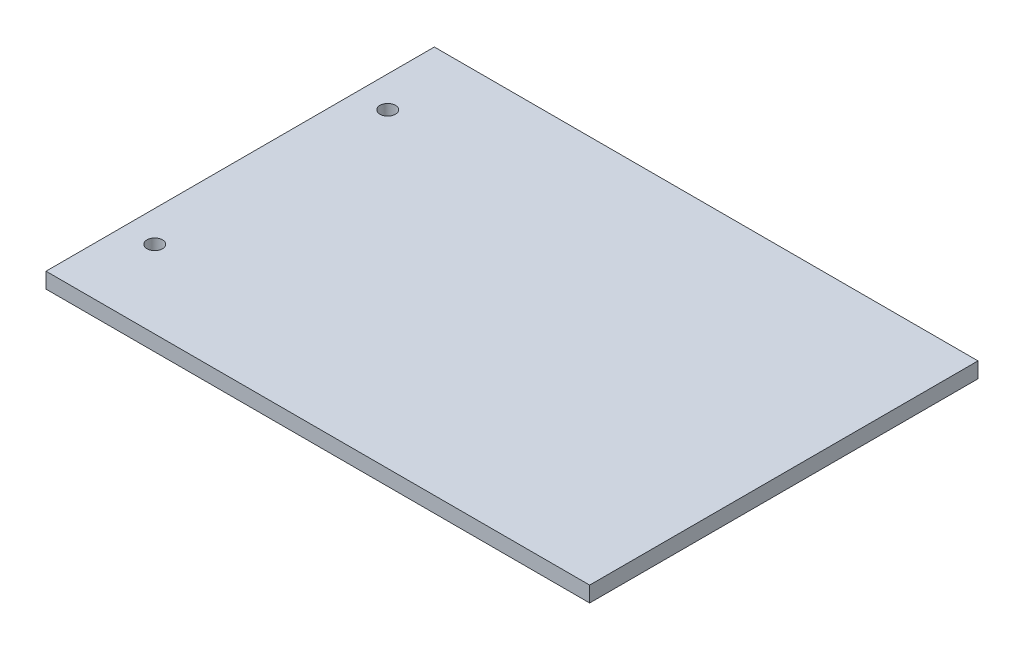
ISO-10303-21;
HEADER;
FILE_DESCRIPTION(('STEP AP214'),'2;1');
FILE_NAME('part.step','',(''),(''),'','','');
FILE_SCHEMA(('AUTOMOTIVE_DESIGN { 1 0 10303 214 1 1 1 1 }'));
ENDSEC;
DATA;
#1=APPLICATION_CONTEXT('core data for automotive mechanical design processes');
#2=APPLICATION_PROTOCOL_DEFINITION('international standard','automotive_design',2000,#1);
#3=PRODUCT_CONTEXT('',#1,'mechanical');
#4=PRODUCT('Part','Part','',(#3));
#5=PRODUCT_RELATED_PRODUCT_CATEGORY('part','',(#4));
#6=PRODUCT_DEFINITION_FORMATION('','',#4);
#7=PRODUCT_DEFINITION_CONTEXT('part definition',#1,'design');
#8=PRODUCT_DEFINITION('design','',#6,#7);
#9=PRODUCT_DEFINITION_SHAPE('','',#8);
#10=(LENGTH_UNIT() NAMED_UNIT(*) SI_UNIT(.MILLI.,.METRE.));
#11=(NAMED_UNIT(*) PLANE_ANGLE_UNIT() SI_UNIT($,.RADIAN.));
#12=(NAMED_UNIT(*) SI_UNIT($,.STERADIAN.) SOLID_ANGLE_UNIT());
#13=UNCERTAINTY_MEASURE_WITH_UNIT(LENGTH_MEASURE(1.E-05),#10,'distance_accuracy_value','');
#14=(GEOMETRIC_REPRESENTATION_CONTEXT(3) GLOBAL_UNCERTAINTY_ASSIGNED_CONTEXT((#13)) GLOBAL_UNIT_ASSIGNED_CONTEXT((#10,
#11,#12)) REPRESENTATION_CONTEXT('',''));
#15=CARTESIAN_POINT('',(0.,0.,0.));
#16=DIRECTION('',(0.,0.,1.));
#17=DIRECTION('',(1.,0.,0.));
#18=AXIS2_PLACEMENT_3D('',#15,#16,#17);
#19=CARTESIAN_POINT('',(0.,2.,0.));
#20=DIRECTION('',(0.,1.,0.));
#21=DIRECTION('',(0.,0.,1.));
#22=AXIS2_PLACEMENT_3D('',#19,#20,#21);
#23=PLANE('',#22);
#24=CARTESIAN_POINT('',(-31.,2.,-15.));
#25=DIRECTION('',(0.,1.,0.));
#26=DIRECTION('',(0.,0.,1.));
#27=AXIS2_PLACEMENT_3D('',#24,#25,#26);
#28=CIRCLE('',#27,1.);
#29=CARTESIAN_POINT('',(-31.,2.,-14.));
#30=VERTEX_POINT('',#29);
#31=EDGE_CURVE('E100',#30,#30,#28,.T.);
#32=ORIENTED_EDGE('',*,*,#31,.F.);
#33=EDGE_LOOP('',(#32));
#34=FACE_BOUND('',#33,.T.);
#35=DIRECTION('',(0.,0.,-1.));
#36=VECTOR('',#35,1.);
#37=CARTESIAN_POINT('',(35.,2.,-25.));
#38=LINE('',#37,#36);
#39=CARTESIAN_POINT('',(35.,2.,25.));
#40=VERTEX_POINT('',#39);
#41=CARTESIAN_POINT('',(35.,2.,-25.));
#42=VERTEX_POINT('',#41);
#43=EDGE_CURVE('E85',#40,#42,#38,.T.);
#44=ORIENTED_EDGE('',*,*,#43,.T.);
#45=DIRECTION('',(-1.,0.,0.));
#46=VECTOR('',#45,1.);
#47=CARTESIAN_POINT('',(-35.,2.,-25.));
#48=LINE('',#47,#46);
#49=CARTESIAN_POINT('',(-35.,2.,-25.));
#50=VERTEX_POINT('',#49);
#51=EDGE_CURVE('E80',#42,#50,#48,.T.);
#52=ORIENTED_EDGE('',*,*,#51,.T.);
#53=DIRECTION('',(0.,0.,1.));
#54=VECTOR('',#53,1.);
#55=CARTESIAN_POINT('',(-35.,2.,-25.));
#56=LINE('',#55,#54);
#57=CARTESIAN_POINT('',(-35.,2.,25.));
#58=VERTEX_POINT('',#57);
#59=EDGE_CURVE('E83',#50,#58,#56,.T.);
#60=ORIENTED_EDGE('',*,*,#59,.T.);
#61=DIRECTION('',(1.,0.,0.));
#62=VECTOR('',#61,1.);
#63=CARTESIAN_POINT('',(-35.,2.,25.));
#64=LINE('',#63,#62);
#65=EDGE_CURVE('E50',#58,#40,#64,.T.);
#66=ORIENTED_EDGE('',*,*,#65,.T.);
#67=EDGE_LOOP('',(#44,#52,#60,#66));
#68=FACE_BOUND('',#67,.T.);
#69=CARTESIAN_POINT('',(-31.,2.,15.));
#70=DIRECTION('',(0.,1.,0.));
#71=DIRECTION('',(0.,0.,1.));
#72=AXIS2_PLACEMENT_3D('',#69,#70,#71);
#73=CIRCLE('',#72,1.);
#74=CARTESIAN_POINT('',(-31.,2.,16.));
#75=VERTEX_POINT('',#74);
#76=EDGE_CURVE('E115',#75,#75,#73,.T.);
#77=ORIENTED_EDGE('',*,*,#76,.F.);
#78=EDGE_LOOP('',(#77));
#79=FACE_BOUND('',#78,.T.);
#80=ADVANCED_FACE('F33',(#34,#68,#79),#23,.T.);
#81=CARTESIAN_POINT('',(0.,0.,0.));
#82=DIRECTION('',(0.,1.,0.));
#83=DIRECTION('',(0.,0.,1.));
#84=AXIS2_PLACEMENT_3D('',#81,#82,#83);
#85=PLANE('',#84);
#86=DIRECTION('',(0.,0.,-1.));
#87=VECTOR('',#86,1.);
#88=CARTESIAN_POINT('',(35.,0.,-25.));
#89=LINE('',#88,#87);
#90=CARTESIAN_POINT('',(35.,0.,25.));
#91=VERTEX_POINT('',#90);
#92=CARTESIAN_POINT('',(35.,0.,-25.));
#93=VERTEX_POINT('',#92);
#94=EDGE_CURVE('E97',#91,#93,#89,.T.);
#95=ORIENTED_EDGE('',*,*,#94,.F.);
#96=DIRECTION('',(1.,0.,0.));
#97=VECTOR('',#96,1.);
#98=CARTESIAN_POINT('',(-35.,0.,25.));
#99=LINE('',#98,#97);
#100=CARTESIAN_POINT('',(-35.,0.,25.));
#101=VERTEX_POINT('',#100);
#102=EDGE_CURVE('E73',#101,#91,#99,.T.);
#103=ORIENTED_EDGE('',*,*,#102,.F.);
#104=DIRECTION('',(0.,0.,1.));
#105=VECTOR('',#104,1.);
#106=CARTESIAN_POINT('',(-35.,0.,-25.));
#107=LINE('',#106,#105);
#108=CARTESIAN_POINT('',(-35.,0.,-25.));
#109=VERTEX_POINT('',#108);
#110=EDGE_CURVE('E67',#109,#101,#107,.T.);
#111=ORIENTED_EDGE('',*,*,#110,.F.);
#112=DIRECTION('',(-1.,0.,0.));
#113=VECTOR('',#112,1.);
#114=CARTESIAN_POINT('',(-35.,0.,-25.));
#115=LINE('',#114,#113);
#116=EDGE_CURVE('E89',#93,#109,#115,.T.);
#117=ORIENTED_EDGE('',*,*,#116,.F.);
#118=EDGE_LOOP('',(#95,#103,#111,#117));
#119=FACE_BOUND('',#118,.T.);
#120=CARTESIAN_POINT('',(-31.,0.,-15.));
#121=DIRECTION('',(0.,1.,0.));
#122=DIRECTION('',(0.,0.,1.));
#123=AXIS2_PLACEMENT_3D('',#120,#121,#122);
#124=CIRCLE('',#123,1.);
#125=CARTESIAN_POINT('',(-31.,0.,-14.));
#126=VERTEX_POINT('',#125);
#127=EDGE_CURVE('E112',#126,#126,#124,.T.);
#128=ORIENTED_EDGE('',*,*,#127,.T.);
#129=EDGE_LOOP('',(#128));
#130=FACE_BOUND('',#129,.T.);
#131=CARTESIAN_POINT('',(-31.,0.,15.));
#132=DIRECTION('',(0.,1.,0.));
#133=DIRECTION('',(0.,0.,1.));
#134=AXIS2_PLACEMENT_3D('',#131,#132,#133);
#135=CIRCLE('',#134,1.);
#136=CARTESIAN_POINT('',(-31.,0.,16.));
#137=VERTEX_POINT('',#136);
#138=EDGE_CURVE('E118',#137,#137,#135,.T.);
#139=ORIENTED_EDGE('',*,*,#138,.T.);
#140=EDGE_LOOP('',(#139));
#141=FACE_BOUND('',#140,.T.);
#142=ADVANCED_FACE('F108',(#119,#130,#141),#85,.F.);
#143=CARTESIAN_POINT('',(35.,2.,-25.));
#144=DIRECTION('',(-1.,0.,0.));
#145=DIRECTION('',(0.,0.,1.));
#146=AXIS2_PLACEMENT_3D('',#143,#144,#145);
#147=PLANE('',#146);
#148=ORIENTED_EDGE('',*,*,#94,.T.);
#149=DIRECTION('',(0.,-1.,0.));
#150=VECTOR('',#149,1.);
#151=CARTESIAN_POINT('',(35.,2.,-25.));
#152=LINE('',#151,#150);
#153=EDGE_CURVE('E11',#42,#93,#152,.T.);
#154=ORIENTED_EDGE('',*,*,#153,.F.);
#155=ORIENTED_EDGE('',*,*,#43,.F.);
#156=DIRECTION('',(0.,-1.,0.));
#157=VECTOR('',#156,1.);
#158=CARTESIAN_POINT('',(35.,2.,25.));
#159=LINE('',#158,#157);
#160=EDGE_CURVE('E93',#40,#91,#159,.T.);
#161=ORIENTED_EDGE('',*,*,#160,.T.);
#162=EDGE_LOOP('',(#148,#154,#155,#161));
#163=FACE_BOUND('',#162,.T.);
#164=ADVANCED_FACE('F35',(#163),#147,.F.);
#165=CARTESIAN_POINT('',(-35.,2.,-25.));
#166=DIRECTION('',(0.,0.,1.));
#167=DIRECTION('',(1.,0.,0.));
#168=AXIS2_PLACEMENT_3D('',#165,#166,#167);
#169=PLANE('',#168);
#170=ORIENTED_EDGE('',*,*,#116,.T.);
#171=DIRECTION('',(0.,-1.,0.));
#172=VECTOR('',#171,1.);
#173=CARTESIAN_POINT('',(-35.,2.,-25.));
#174=LINE('',#173,#172);
#175=EDGE_CURVE('E42',#50,#109,#174,.T.);
#176=ORIENTED_EDGE('',*,*,#175,.F.);
#177=ORIENTED_EDGE('',*,*,#51,.F.);
#178=ORIENTED_EDGE('',*,*,#153,.T.);
#179=EDGE_LOOP('',(#170,#176,#177,#178));
#180=FACE_BOUND('',#179,.T.);
#181=ADVANCED_FACE('F88',(#180),#169,.F.);
#182=CARTESIAN_POINT('',(-35.,2.,-25.));
#183=DIRECTION('',(1.,0.,0.));
#184=DIRECTION('',(0.,0.,-1.));
#185=AXIS2_PLACEMENT_3D('',#182,#183,#184);
#186=PLANE('',#185);
#187=ORIENTED_EDGE('',*,*,#110,.T.);
#188=DIRECTION('',(0.,-1.,0.));
#189=VECTOR('',#188,1.);
#190=CARTESIAN_POINT('',(-35.,2.,25.));
#191=LINE('',#190,#189);
#192=EDGE_CURVE('E90',#58,#101,#191,.T.);
#193=ORIENTED_EDGE('',*,*,#192,.F.);
#194=ORIENTED_EDGE('',*,*,#59,.F.);
#195=ORIENTED_EDGE('',*,*,#175,.T.);
#196=EDGE_LOOP('',(#187,#193,#194,#195));
#197=FACE_BOUND('',#196,.T.);
#198=ADVANCED_FACE('F91',(#197),#186,.F.);
#199=CARTESIAN_POINT('',(-35.,2.,25.));
#200=DIRECTION('',(0.,0.,-1.));
#201=DIRECTION('',(-1.,0.,0.));
#202=AXIS2_PLACEMENT_3D('',#199,#200,#201);
#203=PLANE('',#202);
#204=ORIENTED_EDGE('',*,*,#102,.T.);
#205=ORIENTED_EDGE('',*,*,#160,.F.);
#206=ORIENTED_EDGE('',*,*,#65,.F.);
#207=ORIENTED_EDGE('',*,*,#192,.T.);
#208=EDGE_LOOP('',(#204,#205,#206,#207));
#209=FACE_BOUND('',#208,.T.);
#210=ADVANCED_FACE('F105',(#209),#203,.F.);
#211=CARTESIAN_POINT('',(-31.,2.,-15.));
#212=DIRECTION('',(0.,-1.,0.));
#213=DIRECTION('',(0.,0.,-1.));
#214=AXIS2_PLACEMENT_3D('',#211,#212,#213);
#215=CYLINDRICAL_SURFACE('',#214,1.);
#216=ORIENTED_EDGE('',*,*,#31,.T.);
#217=EDGE_LOOP('',(#216));
#218=FACE_BOUND('',#217,.T.);
#219=ORIENTED_EDGE('',*,*,#127,.F.);
#220=EDGE_LOOP('',(#219));
#221=FACE_BOUND('',#220,.T.);
#222=ADVANCED_FACE('F135',(#218,#221),#215,.F.);
#223=CARTESIAN_POINT('',(-31.,2.,15.));
#224=DIRECTION('',(0.,-1.,0.));
#225=DIRECTION('',(0.,0.,-1.));
#226=AXIS2_PLACEMENT_3D('',#223,#224,#225);
#227=CYLINDRICAL_SURFACE('',#226,1.);
#228=ORIENTED_EDGE('',*,*,#76,.T.);
#229=EDGE_LOOP('',(#228));
#230=FACE_BOUND('',#229,.T.);
#231=ORIENTED_EDGE('',*,*,#138,.F.);
#232=EDGE_LOOP('',(#231));
#233=FACE_BOUND('',#232,.T.);
#234=ADVANCED_FACE('F124',(#230,#233),#227,.F.);
#235=CLOSED_SHELL('',(#80,#142,#164,#181,#198,#210,#222,#234));
#236=MANIFOLD_SOLID_BREP('B2',#235);
#237=ADVANCED_BREP_SHAPE_REPRESENTATION('',(#18,#236),#14);
#238=SHAPE_DEFINITION_REPRESENTATION(#9,#237);
ENDSEC;
END-ISO-10303-21;
